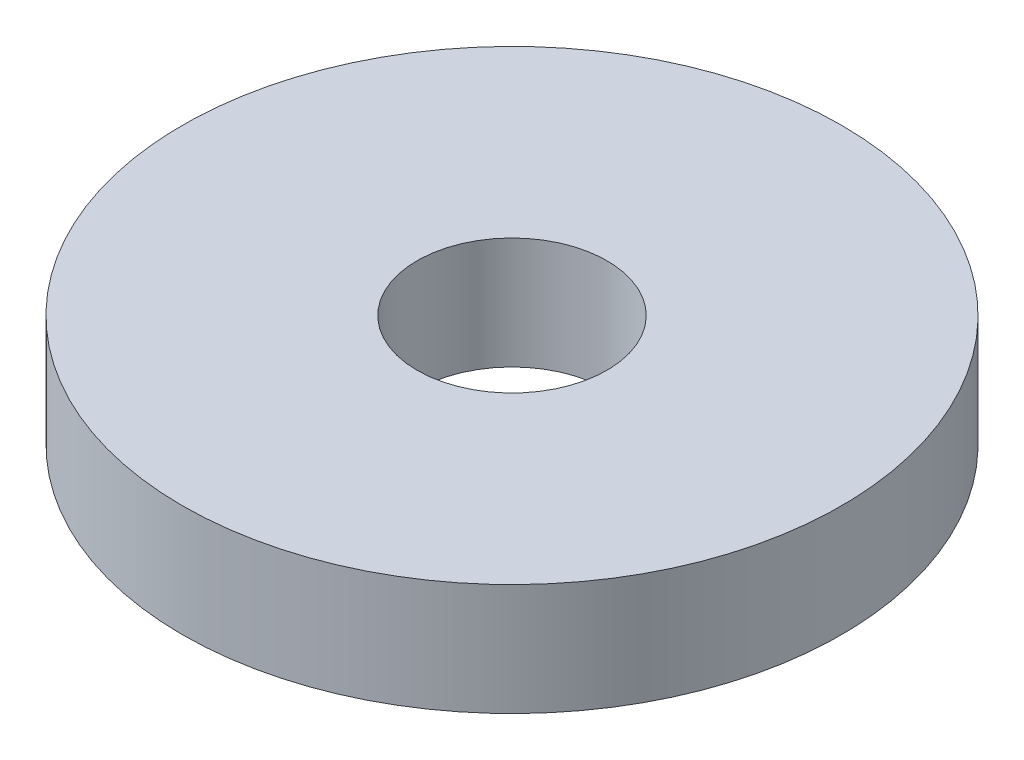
from build123d import *

# Parameters (mm, degrees)
ESQUISSE1_R      = 29.5
ESQUISSE1_R_2    = 8.5
EXTRUSION1_DEPTH = 10


with BuildPart() as part:
    # Esquisse1 → Extrusion1 (new body)
    with BuildSketch(Plane(origin=(0, 0, 0), x_dir=(1, 0, 0), z_dir=(0, 1, 0))):
        with Locations(Location((0, 0, 0), (0, 0, 270))):
            Circle(ESQUISSE1_R)
        with Locations(Location((0, 0, 0), (0, 0, 270))):
            Circle(ESQUISSE1_R_2, mode=Mode.SUBTRACT)
    extrude(amount=EXTRUSION1_DEPTH)


solid = part.part
